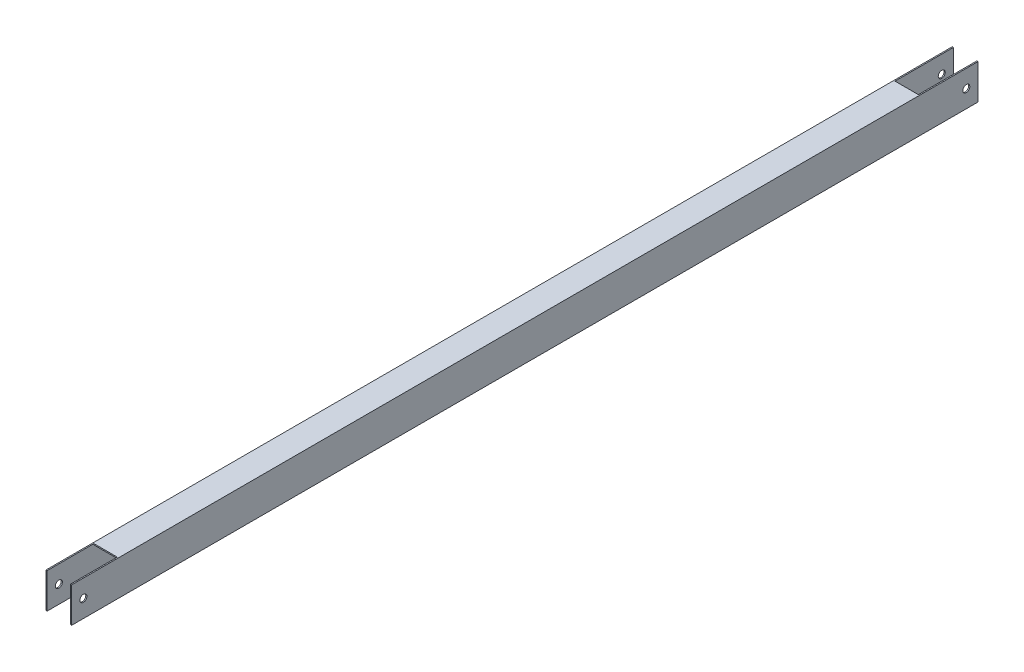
ISO-10303-21;
HEADER;
FILE_DESCRIPTION(('STEP AP214'),'2;1');
FILE_NAME('part.step','',(''),(''),'','','');
FILE_SCHEMA(('AUTOMOTIVE_DESIGN { 1 0 10303 214 1 1 1 1 }'));
ENDSEC;
DATA;
#1=APPLICATION_CONTEXT('core data for automotive mechanical design processes');
#2=APPLICATION_PROTOCOL_DEFINITION('international standard','automotive_design',2000,#1);
#3=PRODUCT_CONTEXT('',#1,'mechanical');
#4=PRODUCT('Part','Part','',(#3));
#5=PRODUCT_RELATED_PRODUCT_CATEGORY('part','',(#4));
#6=PRODUCT_DEFINITION_FORMATION('','',#4);
#7=PRODUCT_DEFINITION_CONTEXT('part definition',#1,'design');
#8=PRODUCT_DEFINITION('design','',#6,#7);
#9=PRODUCT_DEFINITION_SHAPE('','',#8);
#10=(LENGTH_UNIT() NAMED_UNIT(*) SI_UNIT(.MILLI.,.METRE.));
#11=(NAMED_UNIT(*) PLANE_ANGLE_UNIT() SI_UNIT($,.RADIAN.));
#12=(NAMED_UNIT(*) SI_UNIT($,.STERADIAN.) SOLID_ANGLE_UNIT());
#13=UNCERTAINTY_MEASURE_WITH_UNIT(LENGTH_MEASURE(1.E-05),#10,'distance_accuracy_value','');
#14=(GEOMETRIC_REPRESENTATION_CONTEXT(3) GLOBAL_UNCERTAINTY_ASSIGNED_CONTEXT((#13)) GLOBAL_UNIT_ASSIGNED_CONTEXT((#10,
#11,#12)) REPRESENTATION_CONTEXT('',''));
#15=CARTESIAN_POINT('',(0.,0.,0.));
#16=DIRECTION('',(0.,0.,1.));
#17=DIRECTION('',(1.,0.,0.));
#18=AXIS2_PLACEMENT_3D('',#15,#16,#17);
#19=CARTESIAN_POINT('',(-22.,30.,0.));
#20=DIRECTION('',(1.,0.,0.));
#21=DIRECTION('',(0.,1.,0.));
#22=AXIS2_PLACEMENT_3D('',#19,#20,#21);
#23=PLANE('',#22);
#24=CARTESIAN_POINT('',(-22.,0.,-20.));
#25=DIRECTION('',(1.,0.,0.));
#26=DIRECTION('',(0.,0.,-1.));
#27=AXIS2_PLACEMENT_3D('',#24,#25,#26);
#28=CIRCLE('',#27,5.99999999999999);
#29=CARTESIAN_POINT('',(-22.,0.,-26.));
#30=VERTEX_POINT('',#29);
#31=EDGE_CURVE('E224',#30,#30,#28,.T.);
#32=ORIENTED_EDGE('',*,*,#31,.T.);
#33=EDGE_LOOP('',(#32));
#34=FACE_BOUND('',#33,.T.);
#35=DIRECTION('',(0.,0.,-1.));
#36=VECTOR('',#35,1.);
#37=CARTESIAN_POINT('',(-22.,-30.,0.));
#38=LINE('',#37,#36);
#39=CARTESIAN_POINT('',(-22.,-30.,0.));
#40=VERTEX_POINT('',#39);
#41=CARTESIAN_POINT('',(-22.,-30.,-1550.));
#42=VERTEX_POINT('',#41);
#43=EDGE_CURVE('E175',#40,#42,#38,.T.);
#44=ORIENTED_EDGE('',*,*,#43,.F.);
#45=DIRECTION('',(0.,-1.,0.));
#46=VECTOR('',#45,1.);
#47=CARTESIAN_POINT('',(-22.,30.,0.));
#48=LINE('',#47,#46);
#49=CARTESIAN_POINT('',(-22.,30.,0.));
#50=VERTEX_POINT('',#49);
#51=EDGE_CURVE('E171',#50,#40,#48,.T.);
#52=ORIENTED_EDGE('',*,*,#51,.F.);
#53=DIRECTION('',(0.,0.,-1.));
#54=VECTOR('',#53,1.);
#55=CARTESIAN_POINT('',(-22.,30.,0.));
#56=LINE('',#55,#54);
#57=CARTESIAN_POINT('',(-22.,30.,-1550.));
#58=VERTEX_POINT('',#57);
#59=EDGE_CURVE('E165',#50,#58,#56,.T.);
#60=ORIENTED_EDGE('',*,*,#59,.T.);
#61=DIRECTION('',(0.,1.,0.));
#62=VECTOR('',#61,1.);
#63=CARTESIAN_POINT('',(-22.,30.,-1550.));
#64=LINE('',#63,#62);
#65=EDGE_CURVE('E170',#42,#58,#64,.T.);
#66=ORIENTED_EDGE('',*,*,#65,.F.);
#67=EDGE_LOOP('',(#44,#52,#60,#66));
#68=FACE_BOUND('',#67,.T.);
#69=CARTESIAN_POINT('',(-22.,0.,-1530.));
#70=DIRECTION('',(-1.,0.,0.));
#71=DIRECTION('',(0.,0.,1.));
#72=AXIS2_PLACEMENT_3D('',#69,#70,#71);
#73=CIRCLE('',#72,5.99999999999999);
#74=CARTESIAN_POINT('',(-22.,0.,-1524.));
#75=VERTEX_POINT('',#74);
#76=EDGE_CURVE('E389',#75,#75,#73,.T.);
#77=ORIENTED_EDGE('',*,*,#76,.F.);
#78=EDGE_LOOP('',(#77));
#79=FACE_BOUND('',#78,.T.);
#80=ADVANCED_FACE('F46',(#34,#68,#79),#23,.F.);
#81=CARTESIAN_POINT('',(0.,0.,-1450.));
#82=DIRECTION('',(0.,0.,1.));
#83=DIRECTION('',(1.,0.,0.));
#84=AXIS2_PLACEMENT_3D('',#81,#82,#83);
#85=PLANE('',#84);
#86=DIRECTION('',(0.,-1.,0.));
#87=VECTOR('',#86,1.);
#88=CARTESIAN_POINT('',(-20.,30.,-1450.));
#89=LINE('',#88,#87);
#90=CARTESIAN_POINT('',(-20.,30.,-1450.));
#91=VERTEX_POINT('',#90);
#92=CARTESIAN_POINT('',(-20.,28.,-1450.));
#93=VERTEX_POINT('',#92);
#94=EDGE_CURVE('E191',#91,#93,#89,.T.);
#95=ORIENTED_EDGE('',*,*,#94,.F.);
#96=DIRECTION('',(-1.,0.,0.));
#97=VECTOR('',#96,1.);
#98=CARTESIAN_POINT('',(-22.,30.,-1450.));
#99=LINE('',#98,#97);
#100=CARTESIAN_POINT('',(20.,30.,-1450.));
#101=VERTEX_POINT('',#100);
#102=EDGE_CURVE('E269',#101,#91,#99,.T.);
#103=ORIENTED_EDGE('',*,*,#102,.F.);
#104=DIRECTION('',(0.,1.,0.));
#105=VECTOR('',#104,1.);
#106=CARTESIAN_POINT('',(20.,30.,-1450.));
#107=LINE('',#106,#105);
#108=CARTESIAN_POINT('',(20.,28.,-1450.));
#109=VERTEX_POINT('',#108);
#110=EDGE_CURVE('E12',#109,#101,#107,.T.);
#111=ORIENTED_EDGE('',*,*,#110,.F.);
#112=DIRECTION('',(-1.,0.,0.));
#113=VECTOR('',#112,1.);
#114=CARTESIAN_POINT('',(-20.,28.,-1450.));
#115=LINE('',#114,#113);
#116=EDGE_CURVE('E272',#93,#109,#115,.F.);
#117=ORIENTED_EDGE('',*,*,#116,.F.);
#118=EDGE_LOOP('',(#95,#103,#111,#117));
#119=FACE_BOUND('',#118,.T.);
#120=ADVANCED_FACE('F320',(#119),#85,.F.);
#121=CARTESIAN_POINT('',(-20.,-28.,-1450.));
#122=VERTEX_POINT('',#121);
#123=CARTESIAN_POINT('',(-20.,-30.,-1450.));
#124=VERTEX_POINT('',#123);
#125=EDGE_CURVE('E193',#122,#124,#89,.T.);
#126=ORIENTED_EDGE('',*,*,#125,.F.);
#127=DIRECTION('',(1.,0.,0.));
#128=VECTOR('',#127,1.);
#129=CARTESIAN_POINT('',(-20.,-28.,-1450.));
#130=LINE('',#129,#128);
#131=CARTESIAN_POINT('',(20.,-28.,-1450.));
#132=VERTEX_POINT('',#131);
#133=EDGE_CURVE('E257',#132,#122,#130,.F.);
#134=ORIENTED_EDGE('',*,*,#133,.F.);
#135=CARTESIAN_POINT('',(20.,-30.,-1450.));
#136=VERTEX_POINT('',#135);
#137=EDGE_CURVE('E57',#136,#132,#107,.T.);
#138=ORIENTED_EDGE('',*,*,#137,.F.);
#139=DIRECTION('',(1.,0.,0.));
#140=VECTOR('',#139,1.);
#141=CARTESIAN_POINT('',(-22.,-30.,-1450.));
#142=LINE('',#141,#140);
#143=EDGE_CURVE('E64',#124,#136,#142,.T.);
#144=ORIENTED_EDGE('',*,*,#143,.F.);
#145=EDGE_LOOP('',(#126,#134,#138,#144));
#146=FACE_BOUND('',#145,.T.);
#147=ADVANCED_FACE('F326',(#146),#85,.F.);
#148=CARTESIAN_POINT('',(0.,0.,0.));
#149=DIRECTION('',(0.,0.,1.));
#150=DIRECTION('',(1.,0.,0.));
#151=AXIS2_PLACEMENT_3D('',#148,#149,#150);
#152=PLANE('',#151);
#153=DIRECTION('',(0.,1.,0.));
#154=VECTOR('',#153,1.);
#155=CARTESIAN_POINT('',(20.,28.,0.));
#156=LINE('',#155,#154);
#157=CARTESIAN_POINT('',(20.,30.,0.));
#158=VERTEX_POINT('',#157);
#159=CARTESIAN_POINT('',(20.,-30.,0.));
#160=VERTEX_POINT('',#159);
#161=EDGE_CURVE('E266',#158,#160,#156,.F.);
#162=ORIENTED_EDGE('',*,*,#161,.T.);
#163=DIRECTION('',(1.,0.,0.));
#164=VECTOR('',#163,1.);
#165=CARTESIAN_POINT('',(-22.,-30.,0.));
#166=LINE('',#165,#164);
#167=CARTESIAN_POINT('',(22.,-30.,0.));
#168=VERTEX_POINT('',#167);
#169=EDGE_CURVE('E284',#160,#168,#166,.T.);
#170=ORIENTED_EDGE('',*,*,#169,.T.);
#171=DIRECTION('',(0.,1.,0.));
#172=VECTOR('',#171,1.);
#173=CARTESIAN_POINT('',(22.,30.,0.));
#174=LINE('',#173,#172);
#175=CARTESIAN_POINT('',(22.,30.,0.));
#176=VERTEX_POINT('',#175);
#177=EDGE_CURVE('E289',#168,#176,#174,.T.);
#178=ORIENTED_EDGE('',*,*,#177,.T.);
#179=DIRECTION('',(-1.,0.,0.));
#180=VECTOR('',#179,1.);
#181=CARTESIAN_POINT('',(-22.,30.,0.));
#182=LINE('',#181,#180);
#183=EDGE_CURVE('E279',#176,#158,#182,.T.);
#184=ORIENTED_EDGE('',*,*,#183,.T.);
#185=EDGE_LOOP('',(#162,#170,#178,#184));
#186=FACE_BOUND('',#185,.T.);
#187=ADVANCED_FACE('F335',(#186),#152,.T.);
#188=CARTESIAN_POINT('',(-22.,-30.,0.));
#189=DIRECTION('',(0.,1.,0.));
#190=DIRECTION('',(0.,0.,1.));
#191=AXIS2_PLACEMENT_3D('',#188,#189,#190);
#192=PLANE('',#191);
#193=ORIENTED_EDGE('',*,*,#169,.F.);
#194=DIRECTION('',(0.,0.,1.));
#195=VECTOR('',#194,1.);
#196=CARTESIAN_POINT('',(20.,-30.,-80.));
#197=LINE('',#196,#195);
#198=CARTESIAN_POINT('',(20.,-30.,-80.));
#199=VERTEX_POINT('',#198);
#200=EDGE_CURVE('E242',#199,#160,#197,.T.);
#201=ORIENTED_EDGE('',*,*,#200,.F.);
#202=DIRECTION('',(1.,0.,0.));
#203=VECTOR('',#202,1.);
#204=CARTESIAN_POINT('',(-20.,-30.,-80.));
#205=LINE('',#204,#203);
#206=CARTESIAN_POINT('',(-20.,-30.,-80.));
#207=VERTEX_POINT('',#206);
#208=EDGE_CURVE('E238',#207,#199,#205,.T.);
#209=ORIENTED_EDGE('',*,*,#208,.F.);
#210=DIRECTION('',(0.,0.,1.));
#211=VECTOR('',#210,1.);
#212=CARTESIAN_POINT('',(-20.,-30.,-80.));
#213=LINE('',#212,#211);
#214=CARTESIAN_POINT('',(-20.,-30.,0.));
#215=VERTEX_POINT('',#214);
#216=EDGE_CURVE('E246',#207,#215,#213,.T.);
#217=ORIENTED_EDGE('',*,*,#216,.T.);
#218=EDGE_CURVE('E281',#40,#215,#166,.T.);
#219=ORIENTED_EDGE('',*,*,#218,.F.);
#220=ORIENTED_EDGE('',*,*,#43,.T.);
#221=DIRECTION('',(-1.,0.,0.));
#222=VECTOR('',#221,1.);
#223=CARTESIAN_POINT('',(-22.,-30.,-1550.));
#224=LINE('',#223,#222);
#225=CARTESIAN_POINT('',(-20.,-30.,-1550.));
#226=VERTEX_POINT('',#225);
#227=EDGE_CURVE('E190',#226,#42,#224,.T.);
#228=ORIENTED_EDGE('',*,*,#227,.F.);
#229=DIRECTION('',(0.,0.,1.));
#230=VECTOR('',#229,1.);
#231=CARTESIAN_POINT('',(-20.,-30.,-1550.));
#232=LINE('',#231,#230);
#233=EDGE_CURVE('E200',#226,#124,#232,.T.);
#234=ORIENTED_EDGE('',*,*,#233,.T.);
#235=ORIENTED_EDGE('',*,*,#143,.T.);
#236=DIRECTION('',(0.,0.,1.));
#237=VECTOR('',#236,1.);
#238=CARTESIAN_POINT('',(20.,-30.,-1550.));
#239=LINE('',#238,#237);
#240=CARTESIAN_POINT('',(20.,-30.,-1550.));
#241=VERTEX_POINT('',#240);
#242=EDGE_CURVE('E218',#241,#136,#239,.T.);
#243=ORIENTED_EDGE('',*,*,#242,.F.);
#244=DIRECTION('',(-1.,0.,0.));
#245=VECTOR('',#244,1.);
#246=CARTESIAN_POINT('',(22.,-30.,-1550.));
#247=LINE('',#246,#245);
#248=CARTESIAN_POINT('',(22.,-30.,-1550.));
#249=VERTEX_POINT('',#248);
#250=EDGE_CURVE('E207',#249,#241,#247,.T.);
#251=ORIENTED_EDGE('',*,*,#250,.F.);
#252=DIRECTION('',(0.,0.,-1.));
#253=VECTOR('',#252,1.);
#254=CARTESIAN_POINT('',(22.,-30.,0.));
#255=LINE('',#254,#253);
#256=EDGE_CURVE('E292',#168,#249,#255,.T.);
#257=ORIENTED_EDGE('',*,*,#256,.F.);
#258=EDGE_LOOP('',(#193,#201,#209,#217,#219,#220,#228,#234,#235,#243,#251,#257));
#259=FACE_BOUND('',#258,.T.);
#260=ADVANCED_FACE('F332',(#259),#192,.F.);
#261=CARTESIAN_POINT('',(22.,30.,0.));
#262=DIRECTION('',(-1.,0.,0.));
#263=DIRECTION('',(0.,-1.,0.));
#264=AXIS2_PLACEMENT_3D('',#261,#262,#263);
#265=PLANE('',#264);
#266=CARTESIAN_POINT('',(22.,0.,-1530.));
#267=DIRECTION('',(-1.,0.,0.));
#268=DIRECTION('',(0.,0.,1.));
#269=AXIS2_PLACEMENT_3D('',#266,#267,#268);
#270=CIRCLE('',#269,5.99999999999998);
#271=CARTESIAN_POINT('',(22.,0.,-1524.));
#272=VERTEX_POINT('',#271);
#273=EDGE_CURVE('E344',#272,#272,#270,.T.);
#274=ORIENTED_EDGE('',*,*,#273,.T.);
#275=EDGE_LOOP('',(#274));
#276=FACE_BOUND('',#275,.T.);
#277=CARTESIAN_POINT('',(22.,0.,-20.));
#278=DIRECTION('',(1.,0.,0.));
#279=DIRECTION('',(0.,0.,-1.));
#280=AXIS2_PLACEMENT_3D('',#277,#278,#279);
#281=CIRCLE('',#280,5.99999999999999);
#282=CARTESIAN_POINT('',(22.,0.,-26.));
#283=VERTEX_POINT('',#282);
#284=EDGE_CURVE('E221',#283,#283,#281,.T.);
#285=ORIENTED_EDGE('',*,*,#284,.F.);
#286=EDGE_LOOP('',(#285));
#287=FACE_BOUND('',#286,.T.);
#288=DIRECTION('',(0.,0.,-1.));
#289=VECTOR('',#288,1.);
#290=CARTESIAN_POINT('',(22.,30.,0.));
#291=LINE('',#290,#289);
#292=CARTESIAN_POINT('',(22.,30.,-1550.));
#293=VERTEX_POINT('',#292);
#294=EDGE_CURVE('E291',#176,#293,#291,.T.);
#295=ORIENTED_EDGE('',*,*,#294,.F.);
#296=ORIENTED_EDGE('',*,*,#177,.F.);
#297=ORIENTED_EDGE('',*,*,#256,.T.);
#298=DIRECTION('',(0.,-1.,0.));
#299=VECTOR('',#298,1.);
#300=CARTESIAN_POINT('',(22.,30.,-1550.));
#301=LINE('',#300,#299);
#302=EDGE_CURVE('E204',#293,#249,#301,.T.);
#303=ORIENTED_EDGE('',*,*,#302,.F.);
#304=EDGE_LOOP('',(#295,#296,#297,#303));
#305=FACE_BOUND('',#304,.T.);
#306=ADVANCED_FACE('F334',(#276,#287,#305),#265,.F.);
#307=CARTESIAN_POINT('',(-22.,30.,0.));
#308=DIRECTION('',(0.,-1.,0.));
#309=DIRECTION('',(0.,0.,-1.));
#310=AXIS2_PLACEMENT_3D('',#307,#308,#309);
#311=PLANE('',#310);
#312=DIRECTION('',(-1.,0.,0.));
#313=VECTOR('',#312,1.);
#314=CARTESIAN_POINT('',(-20.,30.,-80.));
#315=LINE('',#314,#313);
#316=CARTESIAN_POINT('',(20.,30.,-80.));
#317=VERTEX_POINT('',#316);
#318=CARTESIAN_POINT('',(-20.,30.,-80.));
#319=VERTEX_POINT('',#318);
#320=EDGE_CURVE('E234',#317,#319,#315,.T.);
#321=ORIENTED_EDGE('',*,*,#320,.F.);
#322=DIRECTION('',(0.,0.,1.));
#323=VECTOR('',#322,1.);
#324=CARTESIAN_POINT('',(20.,30.,-80.));
#325=LINE('',#324,#323);
#326=EDGE_CURVE('E241',#317,#158,#325,.T.);
#327=ORIENTED_EDGE('',*,*,#326,.T.);
#328=ORIENTED_EDGE('',*,*,#183,.F.);
#329=ORIENTED_EDGE('',*,*,#294,.T.);
#330=DIRECTION('',(1.,0.,0.));
#331=VECTOR('',#330,1.);
#332=CARTESIAN_POINT('',(22.,30.,-1550.));
#333=LINE('',#332,#331);
#334=CARTESIAN_POINT('',(20.,30.,-1550.));
#335=VERTEX_POINT('',#334);
#336=EDGE_CURVE('E211',#335,#293,#333,.T.);
#337=ORIENTED_EDGE('',*,*,#336,.F.);
#338=DIRECTION('',(0.,0.,1.));
#339=VECTOR('',#338,1.);
#340=CARTESIAN_POINT('',(20.,30.,-1550.));
#341=LINE('',#340,#339);
#342=EDGE_CURVE('E213',#335,#101,#341,.T.);
#343=ORIENTED_EDGE('',*,*,#342,.T.);
#344=ORIENTED_EDGE('',*,*,#102,.T.);
#345=DIRECTION('',(0.,0.,1.));
#346=VECTOR('',#345,1.);
#347=CARTESIAN_POINT('',(-20.,30.,-1550.));
#348=LINE('',#347,#346);
#349=CARTESIAN_POINT('',(-20.,30.,-1550.));
#350=VERTEX_POINT('',#349);
#351=EDGE_CURVE('E182',#350,#91,#348,.T.);
#352=ORIENTED_EDGE('',*,*,#351,.F.);
#353=DIRECTION('',(1.,0.,0.));
#354=VECTOR('',#353,1.);
#355=CARTESIAN_POINT('',(-22.,30.,-1550.));
#356=LINE('',#355,#354);
#357=EDGE_CURVE('E179',#58,#350,#356,.T.);
#358=ORIENTED_EDGE('',*,*,#357,.F.);
#359=ORIENTED_EDGE('',*,*,#59,.F.);
#360=CARTESIAN_POINT('',(-20.,30.,0.));
#361=VERTEX_POINT('',#360);
#362=EDGE_CURVE('E286',#361,#50,#182,.T.);
#363=ORIENTED_EDGE('',*,*,#362,.F.);
#364=DIRECTION('',(0.,0.,1.));
#365=VECTOR('',#364,1.);
#366=CARTESIAN_POINT('',(-20.,30.,-80.));
#367=LINE('',#366,#365);
#368=EDGE_CURVE('E249',#319,#361,#367,.T.);
#369=ORIENTED_EDGE('',*,*,#368,.F.);
#370=EDGE_LOOP('',(#321,#327,#328,#329,#337,#343,#344,#352,#358,#359,#363,#369));
#371=FACE_BOUND('',#370,.T.);
#372=ADVANCED_FACE('F48',(#371),#311,.F.);
#373=DIRECTION('',(0.,-1.,0.));
#374=VECTOR('',#373,1.);
#375=CARTESIAN_POINT('',(-20.,28.,0.));
#376=LINE('',#375,#374);
#377=EDGE_CURVE('E267',#215,#361,#376,.F.);
#378=ORIENTED_EDGE('',*,*,#377,.T.);
#379=ORIENTED_EDGE('',*,*,#362,.T.);
#380=ORIENTED_EDGE('',*,*,#51,.T.);
#381=ORIENTED_EDGE('',*,*,#218,.T.);
#382=EDGE_LOOP('',(#378,#379,#380,#381));
#383=FACE_BOUND('',#382,.T.);
#384=ADVANCED_FACE('F331',(#383),#152,.T.);
#385=CARTESIAN_POINT('',(-20.,-28.,0.));
#386=DIRECTION('',(0.,-1.,0.));
#387=DIRECTION('',(0.,0.,-1.));
#388=AXIS2_PLACEMENT_3D('',#385,#386,#387);
#389=PLANE('',#388);
#390=DIRECTION('',(0.,0.,-1.));
#391=VECTOR('',#390,1.);
#392=CARTESIAN_POINT('',(-20.,-28.,0.));
#393=LINE('',#392,#391);
#394=CARTESIAN_POINT('',(-20.,-28.,-80.));
#395=VERTEX_POINT('',#394);
#396=EDGE_CURVE('E260',#395,#122,#393,.T.);
#397=ORIENTED_EDGE('',*,*,#396,.F.);
#398=DIRECTION('',(1.,0.,0.));
#399=VECTOR('',#398,1.);
#400=CARTESIAN_POINT('',(-20.,-28.,-80.));
#401=LINE('',#400,#399);
#402=CARTESIAN_POINT('',(20.,-28.,-80.));
#403=VERTEX_POINT('',#402);
#404=EDGE_CURVE('E176',#395,#403,#401,.T.);
#405=ORIENTED_EDGE('',*,*,#404,.T.);
#406=DIRECTION('',(0.,0.,-1.));
#407=VECTOR('',#406,1.);
#408=CARTESIAN_POINT('',(20.,-28.,0.));
#409=LINE('',#408,#407);
#410=EDGE_CURVE('E261',#403,#132,#409,.T.);
#411=ORIENTED_EDGE('',*,*,#410,.T.);
#412=ORIENTED_EDGE('',*,*,#133,.T.);
#413=EDGE_LOOP('',(#397,#405,#411,#412));
#414=FACE_BOUND('',#413,.T.);
#415=ADVANCED_FACE('F382',(#414),#389,.F.);
#416=CARTESIAN_POINT('',(-20.,28.,0.));
#417=DIRECTION('',(-1.,0.,0.));
#418=DIRECTION('',(0.,-1.,0.));
#419=AXIS2_PLACEMENT_3D('',#416,#417,#418);
#420=PLANE('',#419);
#421=CARTESIAN_POINT('',(-20.,0.,-1530.));
#422=DIRECTION('',(-1.,0.,0.));
#423=DIRECTION('',(0.,-1.,0.));
#424=AXIS2_PLACEMENT_3D('',#421,#422,#423);
#425=CIRCLE('',#424,5.99999999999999);
#426=CARTESIAN_POINT('',(-20.,-5.99999999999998,-1530.));
#427=VERTEX_POINT('',#426);
#428=EDGE_CURVE('E50',#427,#427,#425,.T.);
#429=ORIENTED_EDGE('',*,*,#428,.T.);
#430=EDGE_LOOP('',(#429));
#431=FACE_BOUND('',#430,.T.);
#432=CARTESIAN_POINT('',(-20.,0.,-20.));
#433=DIRECTION('',(-1.,0.,0.));
#434=DIRECTION('',(0.,-1.,0.));
#435=AXIS2_PLACEMENT_3D('',#432,#433,#434);
#436=CIRCLE('',#435,5.99999999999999);
#437=CARTESIAN_POINT('',(-20.,-5.99999999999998,-20.));
#438=VERTEX_POINT('',#437);
#439=EDGE_CURVE('E228',#438,#438,#436,.T.);
#440=ORIENTED_EDGE('',*,*,#439,.T.);
#441=EDGE_LOOP('',(#440));
#442=FACE_BOUND('',#441,.T.);
#443=DIRECTION('',(0.,0.,-1.));
#444=VECTOR('',#443,1.);
#445=CARTESIAN_POINT('',(-20.,28.,0.));
#446=LINE('',#445,#444);
#447=CARTESIAN_POINT('',(-20.,28.,-80.));
#448=VERTEX_POINT('',#447);
#449=EDGE_CURVE('E264',#448,#93,#446,.T.);
#450=ORIENTED_EDGE('',*,*,#449,.F.);
#451=DIRECTION('',(0.,-1.,0.));
#452=VECTOR('',#451,1.);
#453=CARTESIAN_POINT('',(-20.,-30.,-80.));
#454=LINE('',#453,#452);
#455=EDGE_CURVE('E72',#319,#448,#454,.T.);
#456=ORIENTED_EDGE('',*,*,#455,.F.);
#457=ORIENTED_EDGE('',*,*,#368,.T.);
#458=ORIENTED_EDGE('',*,*,#377,.F.);
#459=ORIENTED_EDGE('',*,*,#216,.F.);
#460=EDGE_CURVE('E236',#395,#207,#454,.T.);
#461=ORIENTED_EDGE('',*,*,#460,.F.);
#462=ORIENTED_EDGE('',*,*,#396,.T.);
#463=ORIENTED_EDGE('',*,*,#125,.T.);
#464=ORIENTED_EDGE('',*,*,#233,.F.);
#465=DIRECTION('',(0.,-1.,0.));
#466=VECTOR('',#465,1.);
#467=CARTESIAN_POINT('',(-20.,30.,-1550.));
#468=LINE('',#467,#466);
#469=EDGE_CURVE('E185',#350,#226,#468,.T.);
#470=ORIENTED_EDGE('',*,*,#469,.F.);
#471=ORIENTED_EDGE('',*,*,#351,.T.);
#472=ORIENTED_EDGE('',*,*,#94,.T.);
#473=EDGE_LOOP('',(#450,#456,#457,#458,#459,#461,#462,#463,#464,#470,#471,#472));
#474=FACE_BOUND('',#473,.T.);
#475=ADVANCED_FACE('F368',(#431,#442,#474),#420,.F.);
#476=CARTESIAN_POINT('',(-20.,28.,0.));
#477=DIRECTION('',(0.,1.,0.));
#478=DIRECTION('',(0.,0.,1.));
#479=AXIS2_PLACEMENT_3D('',#476,#477,#478);
#480=PLANE('',#479);
#481=DIRECTION('',(0.,0.,-1.));
#482=VECTOR('',#481,1.);
#483=CARTESIAN_POINT('',(20.,28.,0.));
#484=LINE('',#483,#482);
#485=CARTESIAN_POINT('',(20.,28.,-80.));
#486=VERTEX_POINT('',#485);
#487=EDGE_CURVE('E55',#486,#109,#484,.T.);
#488=ORIENTED_EDGE('',*,*,#487,.F.);
#489=DIRECTION('',(-1.,0.,0.));
#490=VECTOR('',#489,1.);
#491=CARTESIAN_POINT('',(-20.,28.,-80.));
#492=LINE('',#491,#490);
#493=EDGE_CURVE('E245',#486,#448,#492,.T.);
#494=ORIENTED_EDGE('',*,*,#493,.T.);
#495=ORIENTED_EDGE('',*,*,#449,.T.);
#496=ORIENTED_EDGE('',*,*,#116,.T.);
#497=EDGE_LOOP('',(#488,#494,#495,#496));
#498=FACE_BOUND('',#497,.T.);
#499=ADVANCED_FACE('F370',(#498),#480,.F.);
#500=CARTESIAN_POINT('',(20.,28.,0.));
#501=DIRECTION('',(1.,0.,0.));
#502=DIRECTION('',(0.,1.,0.));
#503=AXIS2_PLACEMENT_3D('',#500,#501,#502);
#504=PLANE('',#503);
#505=CARTESIAN_POINT('',(20.,0.,-1530.));
#506=DIRECTION('',(1.,0.,0.));
#507=DIRECTION('',(0.,1.,0.));
#508=AXIS2_PLACEMENT_3D('',#505,#506,#507);
#509=CIRCLE('',#508,5.99999999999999);
#510=CARTESIAN_POINT('',(20.,5.99999999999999,-1530.));
#511=VERTEX_POINT('',#510);
#512=EDGE_CURVE('E196',#511,#511,#509,.T.);
#513=ORIENTED_EDGE('',*,*,#512,.T.);
#514=EDGE_LOOP('',(#513));
#515=FACE_BOUND('',#514,.T.);
#516=CARTESIAN_POINT('',(20.,0.,-20.));
#517=DIRECTION('',(1.,0.,0.));
#518=DIRECTION('',(0.,1.,0.));
#519=AXIS2_PLACEMENT_3D('',#516,#517,#518);
#520=CIRCLE('',#519,5.99999999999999);
#521=CARTESIAN_POINT('',(20.,5.99999999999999,-20.));
#522=VERTEX_POINT('',#521);
#523=EDGE_CURVE('E227',#522,#522,#520,.T.);
#524=ORIENTED_EDGE('',*,*,#523,.T.);
#525=EDGE_LOOP('',(#524));
#526=FACE_BOUND('',#525,.T.);
#527=ORIENTED_EDGE('',*,*,#410,.F.);
#528=DIRECTION('',(0.,1.,0.));
#529=VECTOR('',#528,1.);
#530=CARTESIAN_POINT('',(20.,-30.,-80.));
#531=LINE('',#530,#529);
#532=EDGE_CURVE('E232',#199,#403,#531,.T.);
#533=ORIENTED_EDGE('',*,*,#532,.F.);
#534=ORIENTED_EDGE('',*,*,#200,.T.);
#535=ORIENTED_EDGE('',*,*,#161,.F.);
#536=ORIENTED_EDGE('',*,*,#326,.F.);
#537=EDGE_CURVE('E231',#486,#317,#531,.T.);
#538=ORIENTED_EDGE('',*,*,#537,.F.);
#539=ORIENTED_EDGE('',*,*,#487,.T.);
#540=ORIENTED_EDGE('',*,*,#110,.T.);
#541=ORIENTED_EDGE('',*,*,#342,.F.);
#542=DIRECTION('',(0.,1.,0.));
#543=VECTOR('',#542,1.);
#544=CARTESIAN_POINT('',(20.,30.,-1550.));
#545=LINE('',#544,#543);
#546=EDGE_CURVE('E209',#241,#335,#545,.T.);
#547=ORIENTED_EDGE('',*,*,#546,.F.);
#548=ORIENTED_EDGE('',*,*,#242,.T.);
#549=ORIENTED_EDGE('',*,*,#137,.T.);
#550=EDGE_LOOP('',(#527,#533,#534,#535,#536,#538,#539,#540,#541,#547,#548,#549));
#551=FACE_BOUND('',#550,.T.);
#552=ADVANCED_FACE('F300',(#515,#526,#551),#504,.F.);
#553=CARTESIAN_POINT('',(0.,0.,-80.));
#554=DIRECTION('',(0.,0.,-1.));
#555=DIRECTION('',(-1.,0.,0.));
#556=AXIS2_PLACEMENT_3D('',#553,#554,#555);
#557=PLANE('',#556);
#558=ORIENTED_EDGE('',*,*,#537,.T.);
#559=ORIENTED_EDGE('',*,*,#320,.T.);
#560=ORIENTED_EDGE('',*,*,#455,.T.);
#561=ORIENTED_EDGE('',*,*,#493,.F.);
#562=EDGE_LOOP('',(#558,#559,#560,#561));
#563=FACE_BOUND('',#562,.T.);
#564=ADVANCED_FACE('F315',(#563),#557,.F.);
#565=ORIENTED_EDGE('',*,*,#460,.T.);
#566=ORIENTED_EDGE('',*,*,#208,.T.);
#567=ORIENTED_EDGE('',*,*,#532,.T.);
#568=ORIENTED_EDGE('',*,*,#404,.F.);
#569=EDGE_LOOP('',(#565,#566,#567,#568));
#570=FACE_BOUND('',#569,.T.);
#571=ADVANCED_FACE('F306',(#570),#557,.F.);
#572=CARTESIAN_POINT('',(22.,0.,-20.));
#573=DIRECTION('',(1.,0.,0.));
#574=DIRECTION('',(0.,0.,-1.));
#575=AXIS2_PLACEMENT_3D('',#572,#573,#574);
#576=CYLINDRICAL_SURFACE('',#575,5.99999999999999);
#577=ORIENTED_EDGE('',*,*,#284,.T.);
#578=EDGE_LOOP('',(#577));
#579=FACE_BOUND('',#578,.T.);
#580=ORIENTED_EDGE('',*,*,#523,.F.);
#581=EDGE_LOOP('',(#580));
#582=FACE_BOUND('',#581,.T.);
#583=ADVANCED_FACE('F303',(#579,#582),#576,.F.);
#584=ORIENTED_EDGE('',*,*,#31,.F.);
#585=EDGE_LOOP('',(#584));
#586=FACE_BOUND('',#585,.T.);
#587=ORIENTED_EDGE('',*,*,#439,.F.);
#588=EDGE_LOOP('',(#587));
#589=FACE_BOUND('',#588,.T.);
#590=ADVANCED_FACE('F305',(#586,#589),#576,.F.);
#591=CARTESIAN_POINT('',(0.,0.,-1550.));
#592=DIRECTION('',(0.,0.,-1.));
#593=DIRECTION('',(-1.,0.,0.));
#594=AXIS2_PLACEMENT_3D('',#591,#592,#593);
#595=PLANE('',#594);
#596=ORIENTED_EDGE('',*,*,#302,.T.);
#597=ORIENTED_EDGE('',*,*,#250,.T.);
#598=ORIENTED_EDGE('',*,*,#546,.T.);
#599=ORIENTED_EDGE('',*,*,#336,.T.);
#600=EDGE_LOOP('',(#596,#597,#598,#599));
#601=FACE_BOUND('',#600,.T.);
#602=ADVANCED_FACE('F313',(#601),#595,.T.);
#603=CARTESIAN_POINT('',(0.,0.,-1550.));
#604=DIRECTION('',(0.,0.,1.));
#605=DIRECTION('',(1.,0.,0.));
#606=AXIS2_PLACEMENT_3D('',#603,#604,#605);
#607=PLANE('',#606);
#608=ORIENTED_EDGE('',*,*,#65,.T.);
#609=ORIENTED_EDGE('',*,*,#357,.T.);
#610=ORIENTED_EDGE('',*,*,#469,.T.);
#611=ORIENTED_EDGE('',*,*,#227,.T.);
#612=EDGE_LOOP('',(#608,#609,#610,#611));
#613=FACE_BOUND('',#612,.T.);
#614=ADVANCED_FACE('F188',(#613),#607,.F.);
#615=CARTESIAN_POINT('',(-22.,0.,-1530.));
#616=DIRECTION('',(-1.,0.,0.));
#617=DIRECTION('',(0.,0.,1.));
#618=AXIS2_PLACEMENT_3D('',#615,#616,#617);
#619=CYLINDRICAL_SURFACE('',#618,5.99999999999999);
#620=ORIENTED_EDGE('',*,*,#76,.T.);
#621=EDGE_LOOP('',(#620));
#622=FACE_BOUND('',#621,.T.);
#623=ORIENTED_EDGE('',*,*,#428,.F.);
#624=EDGE_LOOP('',(#623));
#625=FACE_BOUND('',#624,.T.);
#626=ADVANCED_FACE('F394',(#622,#625),#619,.F.);
#627=ORIENTED_EDGE('',*,*,#273,.F.);
#628=EDGE_LOOP('',(#627));
#629=FACE_BOUND('',#628,.T.);
#630=ORIENTED_EDGE('',*,*,#512,.F.);
#631=EDGE_LOOP('',(#630));
#632=FACE_BOUND('',#631,.T.);
#633=ADVANCED_FACE('F397',(#629,#632),#619,.F.);
#634=CLOSED_SHELL('',(#80,#120,#147,#187,#260,#306,#372,#384,#415,#475,#499,#552,#564,#571,#583,
#590,#602,#614,#626,#633));
#635=MANIFOLD_SOLID_BREP('B2',#634);
#636=ADVANCED_BREP_SHAPE_REPRESENTATION('',(#18,#635),#14);
#637=SHAPE_DEFINITION_REPRESENTATION(#9,#636);
ENDSEC;
END-ISO-10303-21;
